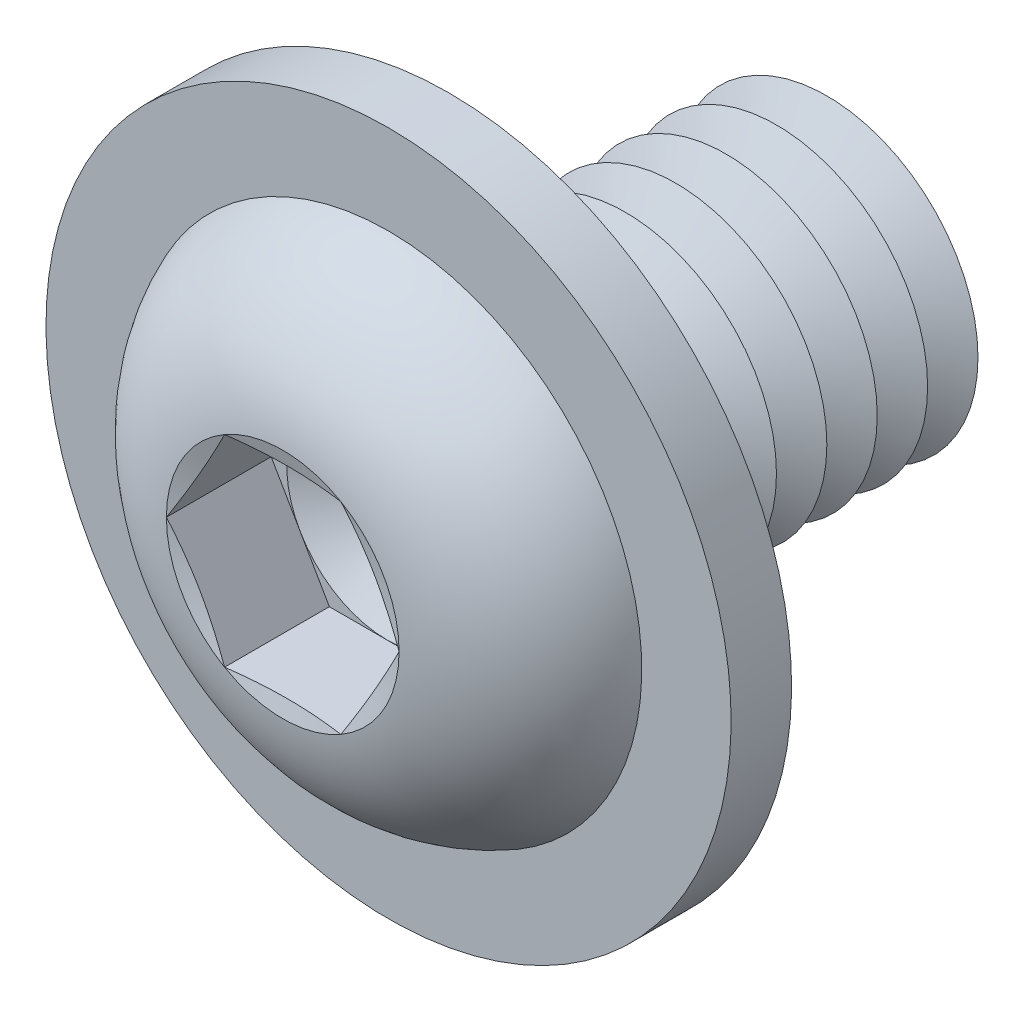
from build123d import *

# Parameters (mm, degrees)
FILLET1_R           = 0.5
LPATTERN1_COUNT     = 8
LPATTERN1_PITCH     = 1
CUT_EXTRUDE1_DEPTH  = 2.08
SKETCH5_R           = 6.8
SKETCH5_R_2         = 3.5
BOSS_EXTRUDE1_DEPTH = 1.2


with BuildPart() as part:
    # Sketch1 → Revolve1 (revolve)
    with BuildSketch(Plane(origin=(0, 0, 0), x_dir=(0, 0, -1), z_dir=(1, 0, 0)), mode=Mode.PRIVATE) as revolve1_sk:
        with BuildLine():
            Line((0, 3), (0, 5.25))
            ThreePointArc((0, 5.25), (-2.210041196, 4.408189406), (-3.3, 2.3094))
            Line((-3.3, 2.3094), (-2.990599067, 1.1547))
            Line((-2.990599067, 1.1547), (-3.3, 1.1547))
            Line((-3.3, 1.1547), (-3.3, 0))
            Line((-3.3, 0), (8, 0))
            Line((8, 0), (8, 3))
            Line((8, 3), (0, 3))
        make_face()
    revolve(revolve1_sk.sketch.rotate(Axis((0, 0, -8), (0, 0, 1)), 90), axis=Axis((0, 0, -8), (0, 0, 1)))

    # Fillet1
    fillet1_edges = [part.edges().sort_by_distance(p)[0] for p in [
        (3, 0, 0),
    ]]
    fillet(fillet1_edges, radius=FILLET1_R)

    # Sketch2 → Cut-Revolve1 (revolve, cut)
    with BuildSketch(Plane(origin=(0, 0, 0), x_dir=(0, 0, -1), z_dir=(1, 0, 0)), mode=Mode.PRIVATE) as cut_revolve1_sk:
        Polygon((7.5, 3), (8.5, 3), (8, 2.133974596), align=None)
    cut_revolve1 = revolve(cut_revolve1_sk.sketch.rotate(Axis((0, 0, -8), (0, 0, -1)), 270), axis=Axis((0, 0, -8), (0, 0, -1)), mode=Mode.SUBTRACT)

    # LPattern1: Cut-Revolve1 ×8
    with Locations(*[(0, 0, i * LPATTERN1_PITCH) for i in range(1, LPATTERN1_COUNT)]):
        add(cut_revolve1, mode=Mode.SUBTRACT)

    # Sketch3 → Cut-Extrude1 (cut)
    with BuildSketch(Plane.XY.offset(3.3)):
        Polygon((1.1547, 1.999999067), (-1.1547, 1.999999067), (-2.3094, 0), (-1.1547, -1.999999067), (1.1547, -1.999999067), (2.3094, 0), align=None)
    extrude(amount=-CUT_EXTRUDE1_DEPTH, mode=Mode.SUBTRACT)

    # Cut-Extrude2 cone 1 section (on through the dimple's axis) → Cut-Extrude2 (revolve, cut)
    with BuildSketch(Plane(origin=(0, 0, 1.22), x_dir=(0, -1, 0), z_dir=(1, 0, 0))):
        Polygon((0, 0), (1.999999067, 0), (0, 1.1547), align=None)
    revolve(axis=Axis((0, 0, 1.22), (0, 0, -1)), mode=Mode.SUBTRACT)

    # Sketch5 → Boss-Extrude1 (add)
    with BuildSketch(Plane(origin=(0, 0, 0), x_dir=(-1, 0, 0), z_dir=(0, 0, -1))):
        with Locations(Location((0, 0, 0), (0, 0, 90))):
            Circle(SKETCH5_R)
        Circle(SKETCH5_R_2, mode=Mode.SUBTRACT)
    extrude(amount=-BOSS_EXTRUDE1_DEPTH)


solid = part.part
